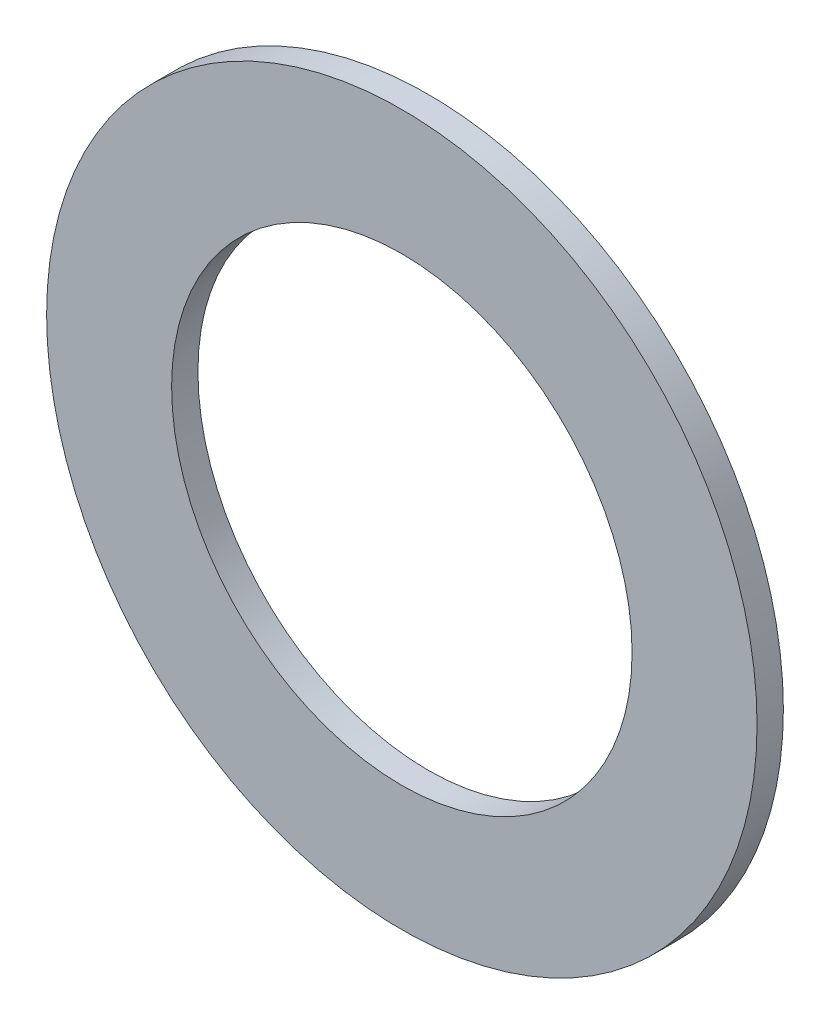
ISO-10303-21;
HEADER;
FILE_DESCRIPTION(('STEP AP214'),'2;1');
FILE_NAME('part.step','',(''),(''),'','','');
FILE_SCHEMA(('AUTOMOTIVE_DESIGN { 1 0 10303 214 1 1 1 1 }'));
ENDSEC;
DATA;
#1=APPLICATION_CONTEXT('core data for automotive mechanical design processes');
#2=APPLICATION_PROTOCOL_DEFINITION('international standard','automotive_design',2000,#1);
#3=PRODUCT_CONTEXT('',#1,'mechanical');
#4=PRODUCT('Part','Part','',(#3));
#5=PRODUCT_RELATED_PRODUCT_CATEGORY('part','',(#4));
#6=PRODUCT_DEFINITION_FORMATION('','',#4);
#7=PRODUCT_DEFINITION_CONTEXT('part definition',#1,'design');
#8=PRODUCT_DEFINITION('design','',#6,#7);
#9=PRODUCT_DEFINITION_SHAPE('','',#8);
#10=(LENGTH_UNIT() NAMED_UNIT(*) SI_UNIT(.MILLI.,.METRE.));
#11=(NAMED_UNIT(*) PLANE_ANGLE_UNIT() SI_UNIT($,.RADIAN.));
#12=(NAMED_UNIT(*) SI_UNIT($,.STERADIAN.) SOLID_ANGLE_UNIT());
#13=UNCERTAINTY_MEASURE_WITH_UNIT(LENGTH_MEASURE(1.E-05),#10,'distance_accuracy_value','');
#14=(GEOMETRIC_REPRESENTATION_CONTEXT(3) GLOBAL_UNCERTAINTY_ASSIGNED_CONTEXT((#13)) GLOBAL_UNIT_ASSIGNED_CONTEXT((#10,
#11,#12)) REPRESENTATION_CONTEXT('',''));
#15=CARTESIAN_POINT('',(0.,0.,0.));
#16=DIRECTION('',(0.,0.,1.));
#17=DIRECTION('',(1.,0.,0.));
#18=AXIS2_PLACEMENT_3D('',#15,#16,#17);
#19=CARTESIAN_POINT('',(3.,52.,0.));
#20=DIRECTION('',(0.,0.,-1.));
#21=DIRECTION('',(-1.,0.,0.));
#22=AXIS2_PLACEMENT_3D('',#19,#20,#21);
#23=PLANE('',#22);
#24=CARTESIAN_POINT('',(3.,52.,0.));
#25=DIRECTION('',(0.,0.,-1.));
#26=DIRECTION('',(-1.,0.,0.));
#27=AXIS2_PLACEMENT_3D('',#24,#25,#26);
#28=CIRCLE('',#27,27.);
#29=CARTESIAN_POINT('',(-24.,52.,0.));
#30=VERTEX_POINT('',#29);
#31=EDGE_CURVE('E10',#30,#30,#28,.T.);
#32=ORIENTED_EDGE('',*,*,#31,.T.);
#33=EDGE_LOOP('',(#32));
#34=FACE_BOUND('',#33,.T.);
#35=CARTESIAN_POINT('',(3.,52.,0.));
#36=DIRECTION('',(0.,0.,-1.));
#37=DIRECTION('',(-1.,0.,0.));
#38=AXIS2_PLACEMENT_3D('',#35,#36,#37);
#39=CIRCLE('',#38,17.5);
#40=CARTESIAN_POINT('',(-14.5,52.,0.));
#41=VERTEX_POINT('',#40);
#42=EDGE_CURVE('E40',#41,#41,#39,.T.);
#43=ORIENTED_EDGE('',*,*,#42,.F.);
#44=EDGE_LOOP('',(#43));
#45=FACE_BOUND('',#44,.T.);
#46=ADVANCED_FACE('F29',(#34,#45),#23,.T.);
#47=CARTESIAN_POINT('',(3.,52.,2.));
#48=DIRECTION('',(0.,0.,-1.));
#49=DIRECTION('',(-1.,0.,0.));
#50=AXIS2_PLACEMENT_3D('',#47,#48,#49);
#51=PLANE('',#50);
#52=CARTESIAN_POINT('',(3.,52.,2.));
#53=DIRECTION('',(0.,0.,-1.));
#54=DIRECTION('',(-1.,0.,0.));
#55=AXIS2_PLACEMENT_3D('',#52,#53,#54);
#56=CIRCLE('',#55,27.);
#57=CARTESIAN_POINT('',(-24.,52.,2.));
#58=VERTEX_POINT('',#57);
#59=EDGE_CURVE('E33',#58,#58,#56,.T.);
#60=ORIENTED_EDGE('',*,*,#59,.F.);
#61=EDGE_LOOP('',(#60));
#62=FACE_BOUND('',#61,.T.);
#63=CARTESIAN_POINT('',(3.,52.,2.));
#64=DIRECTION('',(0.,0.,-1.));
#65=DIRECTION('',(-1.,0.,0.));
#66=AXIS2_PLACEMENT_3D('',#63,#64,#65);
#67=CIRCLE('',#66,17.5);
#68=CARTESIAN_POINT('',(-14.5,52.,2.));
#69=VERTEX_POINT('',#68);
#70=EDGE_CURVE('E42',#69,#69,#67,.T.);
#71=ORIENTED_EDGE('',*,*,#70,.T.);
#72=EDGE_LOOP('',(#71));
#73=FACE_BOUND('',#72,.T.);
#74=ADVANCED_FACE('F52',(#62,#73),#51,.F.);
#75=CARTESIAN_POINT('',(3.,52.,0.));
#76=DIRECTION('',(0.,0.,1.));
#77=DIRECTION('',(1.,0.,0.));
#78=AXIS2_PLACEMENT_3D('',#75,#76,#77);
#79=CYLINDRICAL_SURFACE('',#78,27.);
#80=ORIENTED_EDGE('',*,*,#31,.F.);
#81=EDGE_LOOP('',(#80));
#82=FACE_BOUND('',#81,.T.);
#83=ORIENTED_EDGE('',*,*,#59,.T.);
#84=EDGE_LOOP('',(#83));
#85=FACE_BOUND('',#84,.T.);
#86=ADVANCED_FACE('F31',(#82,#85),#79,.T.);
#87=CARTESIAN_POINT('',(3.,52.,0.));
#88=DIRECTION('',(0.,0.,1.));
#89=DIRECTION('',(1.,0.,0.));
#90=AXIS2_PLACEMENT_3D('',#87,#88,#89);
#91=CYLINDRICAL_SURFACE('',#90,17.5);
#92=ORIENTED_EDGE('',*,*,#42,.T.);
#93=EDGE_LOOP('',(#92));
#94=FACE_BOUND('',#93,.T.);
#95=ORIENTED_EDGE('',*,*,#70,.F.);
#96=EDGE_LOOP('',(#95));
#97=FACE_BOUND('',#96,.T.);
#98=ADVANCED_FACE('F48',(#94,#97),#91,.F.);
#99=CLOSED_SHELL('',(#46,#74,#86,#98));
#100=MANIFOLD_SOLID_BREP('B2',#99);
#101=ADVANCED_BREP_SHAPE_REPRESENTATION('',(#18,#100),#14);
#102=SHAPE_DEFINITION_REPRESENTATION(#9,#101);
ENDSEC;
END-ISO-10303-21;
